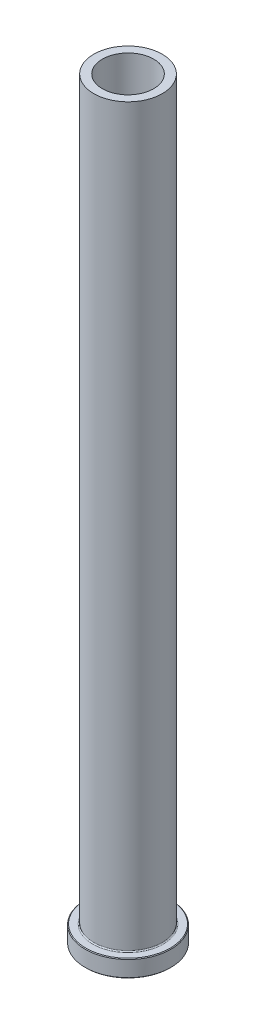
ISO-10303-21;
HEADER;
FILE_DESCRIPTION(('STEP AP214'),'2;1');
FILE_NAME('part.step','',(''),(''),'','','');
FILE_SCHEMA(('AUTOMOTIVE_DESIGN { 1 0 10303 214 1 1 1 1 }'));
ENDSEC;
DATA;
#1=APPLICATION_CONTEXT('core data for automotive mechanical design processes');
#2=APPLICATION_PROTOCOL_DEFINITION('international standard','automotive_design',2000,#1);
#3=PRODUCT_CONTEXT('',#1,'mechanical');
#4=PRODUCT('Part','Part','',(#3));
#5=PRODUCT_RELATED_PRODUCT_CATEGORY('part','',(#4));
#6=PRODUCT_DEFINITION_FORMATION('','',#4);
#7=PRODUCT_DEFINITION_CONTEXT('part definition',#1,'design');
#8=PRODUCT_DEFINITION('design','',#6,#7);
#9=PRODUCT_DEFINITION_SHAPE('','',#8);
#10=(LENGTH_UNIT() NAMED_UNIT(*) SI_UNIT(.MILLI.,.METRE.));
#11=(NAMED_UNIT(*) PLANE_ANGLE_UNIT() SI_UNIT($,.RADIAN.));
#12=(NAMED_UNIT(*) SI_UNIT($,.STERADIAN.) SOLID_ANGLE_UNIT());
#13=UNCERTAINTY_MEASURE_WITH_UNIT(LENGTH_MEASURE(1.E-05),#10,'distance_accuracy_value','');
#14=(GEOMETRIC_REPRESENTATION_CONTEXT(3) GLOBAL_UNCERTAINTY_ASSIGNED_CONTEXT((#13)) GLOBAL_UNIT_ASSIGNED_CONTEXT((#10,
#11,#12)) REPRESENTATION_CONTEXT('',''));
#15=CARTESIAN_POINT('',(0.,0.,0.));
#16=DIRECTION('',(0.,0.,1.));
#17=DIRECTION('',(1.,0.,0.));
#18=AXIS2_PLACEMENT_3D('',#15,#16,#17);
#19=CARTESIAN_POINT('',(0.,0.,0.));
#20=DIRECTION('',(0.,-1.,0.));
#21=DIRECTION('',(0.,0.,-1.));
#22=AXIS2_PLACEMENT_3D('',#19,#20,#21);
#23=PLANE('',#22);
#24=CARTESIAN_POINT('',(0.,0.,0.));
#25=DIRECTION('',(0.,-1.,0.));
#26=DIRECTION('',(0.,0.,-1.));
#27=AXIS2_PLACEMENT_3D('',#24,#25,#26);
#28=CIRCLE('',#27,15.621);
#29=CARTESIAN_POINT('',(0.,0.,-15.621));
#30=VERTEX_POINT('',#29);
#31=EDGE_CURVE('E44',#30,#30,#28,.T.);
#32=ORIENTED_EDGE('',*,*,#31,.T.);
#33=EDGE_LOOP('',(#32));
#34=FACE_BOUND('',#33,.T.);
#35=CARTESIAN_POINT('',(0.,0.,0.));
#36=DIRECTION('',(0.,-1.,0.));
#37=DIRECTION('',(0.,0.,-1.));
#38=AXIS2_PLACEMENT_3D('',#35,#36,#37);
#39=CIRCLE('',#38,10.112375);
#40=CARTESIAN_POINT('',(0.,0.,-10.112375));
#41=VERTEX_POINT('',#40);
#42=EDGE_CURVE('E58',#41,#41,#39,.T.);
#43=ORIENTED_EDGE('',*,*,#42,.F.);
#44=EDGE_LOOP('',(#43));
#45=FACE_BOUND('',#44,.T.);
#46=ADVANCED_FACE('F29',(#34,#45),#23,.T.);
#47=CARTESIAN_POINT('',(0.,0.,0.));
#48=DIRECTION('',(0.,-1.,0.));
#49=DIRECTION('',(0.,0.,-1.));
#50=AXIS2_PLACEMENT_3D('',#47,#48,#49);
#51=CYLINDRICAL_SURFACE('',#50,15.875);
#52=CARTESIAN_POINT('',(0.,0.253999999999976,0.));
#53=DIRECTION('',(0.,-1.,0.));
#54=DIRECTION('',(0.,0.,-1.));
#55=AXIS2_PLACEMENT_3D('',#52,#53,#54);
#56=CIRCLE('',#55,15.875);
#57=CARTESIAN_POINT('',(0.,0.253999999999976,-15.875));
#58=VERTEX_POINT('',#57);
#59=EDGE_CURVE('E36',#58,#58,#56,.F.);
#60=ORIENTED_EDGE('',*,*,#59,.T.);
#61=EDGE_LOOP('',(#60));
#62=FACE_BOUND('',#61,.T.);
#63=CARTESIAN_POINT('',(0.,6.09600000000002,0.));
#64=DIRECTION('',(0.,1.,0.));
#65=DIRECTION('',(0.,0.,1.));
#66=AXIS2_PLACEMENT_3D('',#63,#64,#65);
#67=CIRCLE('',#66,15.875);
#68=CARTESIAN_POINT('',(0.,6.09600000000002,15.875));
#69=VERTEX_POINT('',#68);
#70=EDGE_CURVE('E40',#69,#69,#67,.F.);
#71=ORIENTED_EDGE('',*,*,#70,.T.);
#72=EDGE_LOOP('',(#71));
#73=FACE_BOUND('',#72,.T.);
#74=ADVANCED_FACE('F103',(#62,#73),#51,.T.);
#75=CARTESIAN_POINT('',(15.875,6.35,0.));
#76=DIRECTION('',(0.,1.,0.));
#77=DIRECTION('',(0.,0.,1.));
#78=AXIS2_PLACEMENT_3D('',#75,#76,#77);
#79=PLANE('',#78);
#80=CARTESIAN_POINT('',(0.,6.35,0.));
#81=DIRECTION('',(0.,1.,0.));
#82=DIRECTION('',(0.,0.,1.));
#83=AXIS2_PLACEMENT_3D('',#80,#81,#82);
#84=CIRCLE('',#83,15.621);
#85=CARTESIAN_POINT('',(0.,6.35,15.621));
#86=VERTEX_POINT('',#85);
#87=EDGE_CURVE('E10',#86,#86,#84,.T.);
#88=ORIENTED_EDGE('',*,*,#87,.T.);
#89=EDGE_LOOP('',(#88));
#90=FACE_BOUND('',#89,.T.);
#91=CARTESIAN_POINT('',(0.,6.35,0.));
#92=DIRECTION('',(0.,-1.,0.));
#93=DIRECTION('',(0.,0.,-1.));
#94=AXIS2_PLACEMENT_3D('',#91,#92,#93);
#95=CIRCLE('',#94,13.090525);
#96=CARTESIAN_POINT('',(0.,6.35,-13.090525));
#97=VERTEX_POINT('',#96);
#98=EDGE_CURVE('E49',#97,#97,#95,.T.);
#99=ORIENTED_EDGE('',*,*,#98,.T.);
#100=EDGE_LOOP('',(#99));
#101=FACE_BOUND('',#100,.T.);
#102=ADVANCED_FACE('F109',(#90,#101),#79,.T.);
#103=CARTESIAN_POINT('',(0.,6.746875,0.));
#104=DIRECTION('',(0.,-1.,0.));
#105=DIRECTION('',(0.,0.,-1.));
#106=AXIS2_PLACEMENT_3D('',#103,#104,#105);
#107=TOROIDAL_SURFACE('',#106,13.090525,0.396875);
#108=CARTESIAN_POINT('',(0.,6.746875,0.));
#109=DIRECTION('',(0.,-1.,0.));
#110=DIRECTION('',(0.,0.,-1.));
#111=AXIS2_PLACEMENT_3D('',#108,#109,#110);
#112=CIRCLE('',#111,12.69365);
#113=CARTESIAN_POINT('',(0.,6.746875,-12.69365));
#114=VERTEX_POINT('',#113);
#115=EDGE_CURVE('E52',#114,#114,#112,.T.);
#116=ORIENTED_EDGE('',*,*,#115,.T.);
#117=EDGE_LOOP('',(#116));
#118=FACE_BOUND('',#117,.T.);
#119=ORIENTED_EDGE('',*,*,#98,.F.);
#120=EDGE_LOOP('',(#119));
#121=FACE_BOUND('',#120,.T.);
#122=ADVANCED_FACE('F139',(#118,#121),#107,.F.);
#123=CARTESIAN_POINT('',(0.,0.,0.));
#124=DIRECTION('',(0.,-1.,0.));
#125=DIRECTION('',(0.,0.,-1.));
#126=AXIS2_PLACEMENT_3D('',#123,#124,#125);
#127=CYLINDRICAL_SURFACE('',#126,12.69365);
#128=CARTESIAN_POINT('',(0.,279.4,0.));
#129=DIRECTION('',(0.,-1.,0.));
#130=DIRECTION('',(0.,0.,-1.));
#131=AXIS2_PLACEMENT_3D('',#128,#129,#130);
#132=CIRCLE('',#131,12.69365);
#133=CARTESIAN_POINT('',(0.,279.4,-12.69365));
#134=VERTEX_POINT('',#133);
#135=EDGE_CURVE('E55',#134,#134,#132,.T.);
#136=ORIENTED_EDGE('',*,*,#135,.T.);
#137=EDGE_LOOP('',(#136));
#138=FACE_BOUND('',#137,.T.);
#139=ORIENTED_EDGE('',*,*,#115,.F.);
#140=EDGE_LOOP('',(#139));
#141=FACE_BOUND('',#140,.T.);
#142=ADVANCED_FACE('F182',(#138,#141),#127,.T.);
#143=CARTESIAN_POINT('',(12.69365,279.4,0.));
#144=DIRECTION('',(0.,1.,0.));
#145=DIRECTION('',(0.,0.,1.));
#146=AXIS2_PLACEMENT_3D('',#143,#144,#145);
#147=PLANE('',#146);
#148=CARTESIAN_POINT('',(0.,279.4,0.));
#149=DIRECTION('',(0.,-1.,0.));
#150=DIRECTION('',(0.,0.,-1.));
#151=AXIS2_PLACEMENT_3D('',#148,#149,#150);
#152=CIRCLE('',#151,9.525);
#153=CARTESIAN_POINT('',(0.,279.4,-9.525));
#154=VERTEX_POINT('',#153);
#155=EDGE_CURVE('E70',#154,#154,#152,.T.);
#156=ORIENTED_EDGE('',*,*,#155,.T.);
#157=EDGE_LOOP('',(#156));
#158=FACE_BOUND('',#157,.T.);
#159=ORIENTED_EDGE('',*,*,#135,.F.);
#160=EDGE_LOOP('',(#159));
#161=FACE_BOUND('',#160,.T.);
#162=ADVANCED_FACE('F74',(#158,#161),#147,.T.);
#163=CARTESIAN_POINT('',(0.,0.,0.));
#164=DIRECTION('',(0.,-1.,0.));
#165=DIRECTION('',(0.,0.,-1.));
#166=AXIS2_PLACEMENT_3D('',#163,#164,#165);
#167=CONICAL_SURFACE('',#166,10.112375,0.785398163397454);
#168=CARTESIAN_POINT('',(0.,0.396875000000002,0.));
#169=DIRECTION('',(0.,-1.,0.));
#170=DIRECTION('',(0.,0.,-1.));
#171=AXIS2_PLACEMENT_3D('',#168,#169,#170);
#172=CIRCLE('',#171,9.7155);
#173=CARTESIAN_POINT('',(0.,0.396875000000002,-9.7155));
#174=VERTEX_POINT('',#173);
#175=EDGE_CURVE('E61',#174,#174,#172,.T.);
#176=ORIENTED_EDGE('',*,*,#175,.F.);
#177=EDGE_LOOP('',(#176));
#178=FACE_BOUND('',#177,.T.);
#179=ORIENTED_EDGE('',*,*,#42,.T.);
#180=EDGE_LOOP('',(#179));
#181=FACE_BOUND('',#180,.T.);
#182=ADVANCED_FACE('F93',(#178,#181),#167,.F.);
#183=CARTESIAN_POINT('',(0.,0.,0.));
#184=DIRECTION('',(0.,-1.,0.));
#185=DIRECTION('',(0.,0.,-1.));
#186=AXIS2_PLACEMENT_3D('',#183,#184,#185);
#187=CYLINDRICAL_SURFACE('',#186,9.7155);
#188=CARTESIAN_POINT('',(0.,204.9145,0.));
#189=DIRECTION('',(0.,-1.,0.));
#190=DIRECTION('',(0.,0.,-1.));
#191=AXIS2_PLACEMENT_3D('',#188,#189,#190);
#192=CIRCLE('',#191,9.7155);
#193=CARTESIAN_POINT('',(0.,204.9145,-9.7155));
#194=VERTEX_POINT('',#193);
#195=EDGE_CURVE('E64',#194,#194,#192,.T.);
#196=ORIENTED_EDGE('',*,*,#195,.F.);
#197=EDGE_LOOP('',(#196));
#198=FACE_BOUND('',#197,.T.);
#199=ORIENTED_EDGE('',*,*,#175,.T.);
#200=EDGE_LOOP('',(#199));
#201=FACE_BOUND('',#200,.T.);
#202=ADVANCED_FACE('F87',(#198,#201),#187,.F.);
#203=CARTESIAN_POINT('',(0.,204.9145,0.));
#204=DIRECTION('',(0.,-1.,0.));
#205=DIRECTION('',(0.,0.,-1.));
#206=AXIS2_PLACEMENT_3D('',#203,#204,#205);
#207=CONICAL_SURFACE('',#206,9.7155,0.0133325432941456);
#208=CARTESIAN_POINT('',(0.,219.202,0.));
#209=DIRECTION('',(0.,-1.,0.));
#210=DIRECTION('',(0.,0.,-1.));
#211=AXIS2_PLACEMENT_3D('',#208,#209,#210);
#212=CIRCLE('',#211,9.525);
#213=CARTESIAN_POINT('',(0.,219.202,-9.525));
#214=VERTEX_POINT('',#213);
#215=EDGE_CURVE('E67',#214,#214,#212,.T.);
#216=ORIENTED_EDGE('',*,*,#215,.F.);
#217=EDGE_LOOP('',(#216));
#218=FACE_BOUND('',#217,.T.);
#219=ORIENTED_EDGE('',*,*,#195,.T.);
#220=EDGE_LOOP('',(#219));
#221=FACE_BOUND('',#220,.T.);
#222=ADVANCED_FACE('F81',(#218,#221),#207,.F.);
#223=CARTESIAN_POINT('',(0.,0.,0.));
#224=DIRECTION('',(0.,-1.,0.));
#225=DIRECTION('',(0.,0.,-1.));
#226=AXIS2_PLACEMENT_3D('',#223,#224,#225);
#227=CYLINDRICAL_SURFACE('',#226,9.525);
#228=ORIENTED_EDGE('',*,*,#155,.F.);
#229=EDGE_LOOP('',(#228));
#230=FACE_BOUND('',#229,.T.);
#231=ORIENTED_EDGE('',*,*,#215,.T.);
#232=EDGE_LOOP('',(#231));
#233=FACE_BOUND('',#232,.T.);
#234=ADVANCED_FACE('F77',(#230,#233),#227,.F.);
#235=CARTESIAN_POINT('',(0.,0.,0.));
#236=DIRECTION('',(0.,1.,0.));
#237=DIRECTION('',(0.,0.,1.));
#238=AXIS2_PLACEMENT_3D('',#235,#236,#237);
#239=CONICAL_SURFACE('',#238,15.621,0.785398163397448);
#240=ORIENTED_EDGE('',*,*,#59,.F.);
#241=EDGE_LOOP('',(#240));
#242=FACE_BOUND('',#241,.T.);
#243=ORIENTED_EDGE('',*,*,#31,.F.);
#244=EDGE_LOOP('',(#243));
#245=FACE_BOUND('',#244,.T.);
#246=ADVANCED_FACE('F80',(#242,#245),#239,.T.);
#247=CARTESIAN_POINT('',(0.,6.09600000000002,0.));
#248=DIRECTION('',(0.,-1.,0.));
#249=DIRECTION('',(0.,0.,-1.));
#250=AXIS2_PLACEMENT_3D('',#247,#248,#249);
#251=CONICAL_SURFACE('',#250,15.875,0.785398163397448);
#252=ORIENTED_EDGE('',*,*,#87,.F.);
#253=EDGE_LOOP('',(#252));
#254=FACE_BOUND('',#253,.T.);
#255=ORIENTED_EDGE('',*,*,#70,.F.);
#256=EDGE_LOOP('',(#255));
#257=FACE_BOUND('',#256,.T.);
#258=ADVANCED_FACE('F31',(#254,#257),#251,.T.);
#259=CLOSED_SHELL('',(#46,#74,#102,#122,#142,#162,#182,#202,#222,#234,#246,#258));
#260=MANIFOLD_SOLID_BREP('B2',#259);
#261=ADVANCED_BREP_SHAPE_REPRESENTATION('',(#18,#260),#14);
#262=SHAPE_DEFINITION_REPRESENTATION(#9,#261);
ENDSEC;
END-ISO-10303-21;
